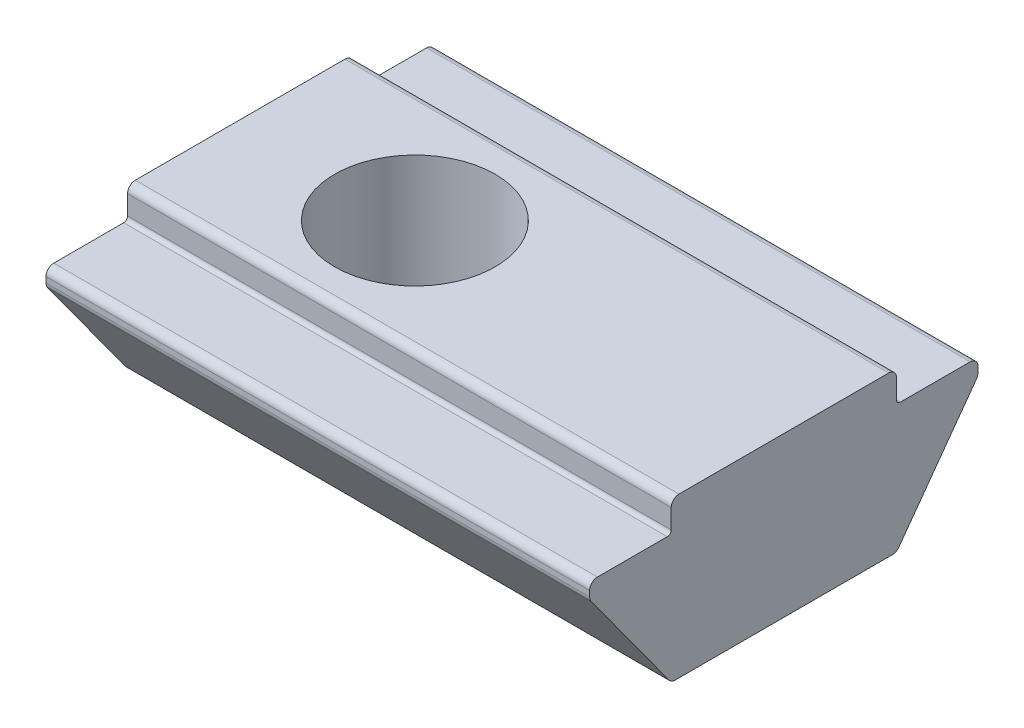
ISO-10303-21;
HEADER;
FILE_DESCRIPTION(('STEP AP214'),'2;1');
FILE_NAME('part.step','',(''),(''),'','','');
FILE_SCHEMA(('AUTOMOTIVE_DESIGN { 1 0 10303 214 1 1 1 1 }'));
ENDSEC;
DATA;
#1=APPLICATION_CONTEXT('core data for automotive mechanical design processes');
#2=APPLICATION_PROTOCOL_DEFINITION('international standard','automotive_design',2000,#1);
#3=PRODUCT_CONTEXT('',#1,'mechanical');
#4=PRODUCT('Part','Part','',(#3));
#5=PRODUCT_RELATED_PRODUCT_CATEGORY('part','',(#4));
#6=PRODUCT_DEFINITION_FORMATION('','',#4);
#7=PRODUCT_DEFINITION_CONTEXT('part definition',#1,'design');
#8=PRODUCT_DEFINITION('design','',#6,#7);
#9=PRODUCT_DEFINITION_SHAPE('','',#8);
#10=(LENGTH_UNIT() NAMED_UNIT(*) SI_UNIT(.MILLI.,.METRE.));
#11=(NAMED_UNIT(*) PLANE_ANGLE_UNIT() SI_UNIT($,.RADIAN.));
#12=(NAMED_UNIT(*) SI_UNIT($,.STERADIAN.) SOLID_ANGLE_UNIT());
#13=UNCERTAINTY_MEASURE_WITH_UNIT(LENGTH_MEASURE(1.E-05),#10,'distance_accuracy_value','');
#14=(GEOMETRIC_REPRESENTATION_CONTEXT(3) GLOBAL_UNCERTAINTY_ASSIGNED_CONTEXT((#13)) GLOBAL_UNIT_ASSIGNED_CONTEXT((#10,
#11,#12)) REPRESENTATION_CONTEXT('',''));
#15=CARTESIAN_POINT('',(0.,0.,0.));
#16=DIRECTION('',(0.,0.,1.));
#17=DIRECTION('',(1.,0.,0.));
#18=AXIS2_PLACEMENT_3D('',#15,#16,#17);
#19=CARTESIAN_POINT('',(9.5,-3.3,-2.9));
#20=DIRECTION('',(0.,1.,0.));
#21=DIRECTION('',(0.,0.,1.));
#22=AXIS2_PLACEMENT_3D('',#19,#20,#21);
#23=PLANE('',#22);
#24=CARTESIAN_POINT('',(0.,-3.3,0.));
#25=DIRECTION('',(0.,1.,0.));
#26=DIRECTION('',(0.,0.,1.));
#27=AXIS2_PLACEMENT_3D('',#24,#25,#26);
#28=CIRCLE('',#27,2.067);
#29=CARTESIAN_POINT('',(0.,-3.3,2.067));
#30=VERTEX_POINT('',#29);
#31=EDGE_CURVE('E595',#30,#30,#28,.T.);
#32=ORIENTED_EDGE('',*,*,#31,.T.);
#33=EDGE_LOOP('',(#32));
#34=FACE_BOUND('',#33,.T.);
#35=DIRECTION('',(0.,0.,-1.));
#36=VECTOR('',#35,1.);
#37=CARTESIAN_POINT('',(-4.5,-3.3,-2.9));
#38=LINE('',#37,#36);
#39=CARTESIAN_POINT('',(-4.5,-3.3,2.79809491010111));
#40=VERTEX_POINT('',#39);
#41=CARTESIAN_POINT('',(-4.5,-3.3,-2.79809491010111));
#42=VERTEX_POINT('',#41);
#43=EDGE_CURVE('E291',#40,#42,#38,.T.);
#44=ORIENTED_EDGE('',*,*,#43,.T.);
#45=DIRECTION('',(-1.,0.,0.));
#46=VECTOR('',#45,1.);
#47=CARTESIAN_POINT('',(9.5,-3.3,-2.79809491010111));
#48=LINE('',#47,#46);
#49=CARTESIAN_POINT('',(9.5,-3.3,-2.79809491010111));
#50=VERTEX_POINT('',#49);
#51=EDGE_CURVE('E11',#42,#50,#48,.F.);
#52=ORIENTED_EDGE('',*,*,#51,.T.);
#53=DIRECTION('',(0.,0.,-1.));
#54=VECTOR('',#53,1.);
#55=CARTESIAN_POINT('',(9.5,-3.3,-2.9));
#56=LINE('',#55,#54);
#57=CARTESIAN_POINT('',(9.5,-3.3,2.79809491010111));
#58=VERTEX_POINT('',#57);
#59=EDGE_CURVE('E294',#58,#50,#56,.T.);
#60=ORIENTED_EDGE('',*,*,#59,.F.);
#61=DIRECTION('',(-1.,0.,0.));
#62=VECTOR('',#61,1.);
#63=CARTESIAN_POINT('',(9.5,-3.3,2.79809491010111));
#64=LINE('',#63,#62);
#65=EDGE_CURVE('E42',#58,#40,#64,.T.);
#66=ORIENTED_EDGE('',*,*,#65,.T.);
#67=EDGE_LOOP('',(#44,#52,#60,#66));
#68=FACE_BOUND('',#67,.T.);
#69=CARTESIAN_POINT('',(6.,-3.3,0.));
#70=DIRECTION('',(0.,1.,0.));
#71=DIRECTION('',(0.,0.,1.));
#72=AXIS2_PLACEMENT_3D('',#69,#70,#71);
#73=CIRCLE('',#72,1.75);
#74=CARTESIAN_POINT('',(6.,-3.3,1.75));
#75=VERTEX_POINT('',#74);
#76=EDGE_CURVE('E329',#75,#75,#73,.T.);
#77=ORIENTED_EDGE('',*,*,#76,.T.);
#78=EDGE_LOOP('',(#77));
#79=FACE_BOUND('',#78,.T.);
#80=ADVANCED_FACE('F34',(#34,#68,#79),#23,.F.);
#81=CARTESIAN_POINT('',(9.5,0.,2.9));
#82=DIRECTION('',(0.,0.,-1.));
#83=DIRECTION('',(0.,1.,0.));
#84=AXIS2_PLACEMENT_3D('',#81,#82,#83);
#85=PLANE('',#84);
#86=DIRECTION('',(0.,-1.,0.));
#87=VECTOR('',#86,1.);
#88=CARTESIAN_POINT('',(9.5,0.,2.9));
#89=LINE('',#88,#87);
#90=CARTESIAN_POINT('',(9.5,0.6,2.9));
#91=VERTEX_POINT('',#90);
#92=CARTESIAN_POINT('',(9.5,0.1,2.9));
#93=VERTEX_POINT('',#92);
#94=EDGE_CURVE('E203',#91,#93,#89,.T.);
#95=ORIENTED_EDGE('',*,*,#94,.F.);
#96=DIRECTION('',(-1.,0.,0.));
#97=VECTOR('',#96,1.);
#98=CARTESIAN_POINT('',(9.5,0.6,2.9));
#99=LINE('',#98,#97);
#100=CARTESIAN_POINT('',(-4.5,0.6,2.9));
#101=VERTEX_POINT('',#100);
#102=EDGE_CURVE('E258',#91,#101,#99,.T.);
#103=ORIENTED_EDGE('',*,*,#102,.T.);
#104=DIRECTION('',(0.,-1.,0.));
#105=VECTOR('',#104,1.);
#106=CARTESIAN_POINT('',(-4.5,0.,2.9));
#107=LINE('',#106,#105);
#108=CARTESIAN_POINT('',(-4.5,0.1,2.9));
#109=VERTEX_POINT('',#108);
#110=EDGE_CURVE('E326',#101,#109,#107,.T.);
#111=ORIENTED_EDGE('',*,*,#110,.T.);
#112=DIRECTION('',(-1.,0.,0.));
#113=VECTOR('',#112,1.);
#114=CARTESIAN_POINT('',(9.5,0.1,2.9));
#115=LINE('',#114,#113);
#116=EDGE_CURVE('E184',#109,#93,#115,.F.);
#117=ORIENTED_EDGE('',*,*,#116,.T.);
#118=EDGE_LOOP('',(#95,#103,#111,#117));
#119=FACE_BOUND('',#118,.T.);
#120=ADVANCED_FACE('F378',(#119),#85,.F.);
#121=CARTESIAN_POINT('',(9.5,0.,5.));
#122=DIRECTION('',(0.,-1.,0.));
#123=DIRECTION('',(0.,0.,-1.));
#124=AXIS2_PLACEMENT_3D('',#121,#122,#123);
#125=PLANE('',#124);
#126=DIRECTION('',(0.,0.,1.));
#127=VECTOR('',#126,1.);
#128=CARTESIAN_POINT('',(-4.5,0.,5.));
#129=LINE('',#128,#127);
#130=CARTESIAN_POINT('',(-4.5,0.,3.));
#131=VERTEX_POINT('',#130);
#132=CARTESIAN_POINT('',(-4.5,0.,4.8));
#133=VERTEX_POINT('',#132);
#134=EDGE_CURVE('E328',#131,#133,#129,.T.);
#135=ORIENTED_EDGE('',*,*,#134,.T.);
#136=DIRECTION('',(-1.,0.,0.));
#137=VECTOR('',#136,1.);
#138=CARTESIAN_POINT('',(9.5,0.,4.8));
#139=LINE('',#138,#137);
#140=CARTESIAN_POINT('',(9.5,0.,4.8));
#141=VERTEX_POINT('',#140);
#142=EDGE_CURVE('E273',#133,#141,#139,.F.);
#143=ORIENTED_EDGE('',*,*,#142,.T.);
#144=DIRECTION('',(0.,0.,1.));
#145=VECTOR('',#144,1.);
#146=CARTESIAN_POINT('',(9.5,0.,5.));
#147=LINE('',#146,#145);
#148=CARTESIAN_POINT('',(9.5,0.,3.));
#149=VERTEX_POINT('',#148);
#150=EDGE_CURVE('E353',#149,#141,#147,.T.);
#151=ORIENTED_EDGE('',*,*,#150,.F.);
#152=DIRECTION('',(-1.,0.,0.));
#153=VECTOR('',#152,1.);
#154=CARTESIAN_POINT('',(-4.5,0.,3.));
#155=LINE('',#154,#153);
#156=EDGE_CURVE('E210',#149,#131,#155,.T.);
#157=ORIENTED_EDGE('',*,*,#156,.T.);
#158=EDGE_LOOP('',(#135,#143,#151,#157));
#159=FACE_BOUND('',#158,.T.);
#160=ADVANCED_FACE('F384',(#159),#125,.F.);
#161=CARTESIAN_POINT('',(9.5,0.,5.));
#162=DIRECTION('',(0.,0.,-1.));
#163=DIRECTION('',(-1.,0.,0.));
#164=AXIS2_PLACEMENT_3D('',#161,#162,#163);
#165=PLANE('',#164);
#166=DIRECTION('',(0.,-1.,0.));
#167=VECTOR('',#166,1.);
#168=CARTESIAN_POINT('',(9.5,0.,5.));
#169=LINE('',#168,#167);
#170=CARTESIAN_POINT('',(9.5,-0.2,5.));
#171=VERTEX_POINT('',#170);
#172=CARTESIAN_POINT('',(9.5,-0.344614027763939,5.));
#173=VERTEX_POINT('',#172);
#174=EDGE_CURVE('E347',#171,#173,#169,.T.);
#175=ORIENTED_EDGE('',*,*,#174,.F.);
#176=DIRECTION('',(-1.,0.,0.));
#177=VECTOR('',#176,1.);
#178=CARTESIAN_POINT('',(9.5,-0.2,5.));
#179=LINE('',#178,#177);
#180=CARTESIAN_POINT('',(-4.5,-0.2,5.));
#181=VERTEX_POINT('',#180);
#182=EDGE_CURVE('E270',#171,#181,#179,.T.);
#183=ORIENTED_EDGE('',*,*,#182,.T.);
#184=DIRECTION('',(0.,-1.,0.));
#185=VECTOR('',#184,1.);
#186=CARTESIAN_POINT('',(-4.5,0.,5.));
#187=LINE('',#186,#185);
#188=CARTESIAN_POINT('',(-4.5,-0.344614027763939,5.));
#189=VERTEX_POINT('',#188);
#190=EDGE_CURVE('E305',#181,#189,#187,.T.);
#191=ORIENTED_EDGE('',*,*,#190,.T.);
#192=DIRECTION('',(-1.,0.,0.));
#193=VECTOR('',#192,1.);
#194=CARTESIAN_POINT('',(9.5,-0.344614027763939,5.));
#195=LINE('',#194,#193);
#196=EDGE_CURVE('E268',#189,#173,#195,.F.);
#197=ORIENTED_EDGE('',*,*,#196,.T.);
#198=EDGE_LOOP('',(#175,#183,#191,#197));
#199=FACE_BOUND('',#198,.T.);
#200=ADVANCED_FACE('F336',(#199),#165,.F.);
#201=CARTESIAN_POINT('',(9.5,-0.409597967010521,5.));
#202=DIRECTION('',(0.,0.587785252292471,-0.809016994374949));
#203=DIRECTION('',(0.,0.809016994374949,0.587785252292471));
#204=AXIS2_PLACEMENT_3D('',#201,#202,#203);
#205=PLANE('',#204);
#206=DIRECTION('',(0.,-0.809016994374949,-0.587785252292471));
#207=VECTOR('',#206,1.);
#208=CARTESIAN_POINT('',(9.5,-0.409597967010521,5.));
#209=LINE('',#208,#207);
#210=CARTESIAN_POINT('',(9.5,-0.462171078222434,4.96180339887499));
#211=VERTEX_POINT('',#210);
#212=CARTESIAN_POINT('',(9.5,-3.21755705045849,2.9598983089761));
#213=VERTEX_POINT('',#212);
#214=EDGE_CURVE('E346',#211,#213,#209,.T.);
#215=ORIENTED_EDGE('',*,*,#214,.F.);
#216=DIRECTION('',(-1.,0.,0.));
#217=VECTOR('',#216,1.);
#218=CARTESIAN_POINT('',(9.5,-0.462171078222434,4.96180339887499));
#219=LINE('',#218,#217);
#220=CARTESIAN_POINT('',(-4.5,-0.462171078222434,4.96180339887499));
#221=VERTEX_POINT('',#220);
#222=EDGE_CURVE('E282',#211,#221,#219,.T.);
#223=ORIENTED_EDGE('',*,*,#222,.T.);
#224=DIRECTION('',(0.,-0.809016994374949,-0.587785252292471));
#225=VECTOR('',#224,1.);
#226=CARTESIAN_POINT('',(-4.5,-0.409597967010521,5.));
#227=LINE('',#226,#225);
#228=CARTESIAN_POINT('',(-4.5,-3.21755705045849,2.9598983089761));
#229=VERTEX_POINT('',#228);
#230=EDGE_CURVE('E301',#221,#229,#227,.T.);
#231=ORIENTED_EDGE('',*,*,#230,.T.);
#232=DIRECTION('',(-1.,0.,0.));
#233=VECTOR('',#232,1.);
#234=CARTESIAN_POINT('',(9.5,-3.21755705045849,2.9598983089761));
#235=LINE('',#234,#233);
#236=EDGE_CURVE('E280',#229,#213,#235,.F.);
#237=ORIENTED_EDGE('',*,*,#236,.T.);
#238=EDGE_LOOP('',(#215,#223,#231,#237));
#239=FACE_BOUND('',#238,.T.);
#240=ADVANCED_FACE('F349',(#239),#205,.F.);
#241=CARTESIAN_POINT('',(9.5,-0.409597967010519,-5.));
#242=DIRECTION('',(0.,0.587785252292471,0.809016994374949));
#243=DIRECTION('',(0.,-0.809016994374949,0.587785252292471));
#244=AXIS2_PLACEMENT_3D('',#241,#242,#243);
#245=PLANE('',#244);
#246=DIRECTION('',(0.,0.809016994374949,-0.587785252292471));
#247=VECTOR('',#246,1.);
#248=CARTESIAN_POINT('',(-4.5,-0.409597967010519,-5.));
#249=LINE('',#248,#247);
#250=CARTESIAN_POINT('',(-4.5,-3.21755705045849,-2.9598983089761));
#251=VERTEX_POINT('',#250);
#252=CARTESIAN_POINT('',(-4.5,-0.462171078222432,-4.96180339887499));
#253=VERTEX_POINT('',#252);
#254=EDGE_CURVE('E300',#251,#253,#249,.T.);
#255=ORIENTED_EDGE('',*,*,#254,.T.);
#256=DIRECTION('',(-1.,0.,0.));
#257=VECTOR('',#256,1.);
#258=CARTESIAN_POINT('',(9.5,-0.462171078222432,-4.96180339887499));
#259=LINE('',#258,#257);
#260=CARTESIAN_POINT('',(9.5,-0.462171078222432,-4.96180339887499));
#261=VERTEX_POINT('',#260);
#262=EDGE_CURVE('E278',#253,#261,#259,.F.);
#263=ORIENTED_EDGE('',*,*,#262,.T.);
#264=DIRECTION('',(0.,0.809016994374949,-0.587785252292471));
#265=VECTOR('',#264,1.);
#266=CARTESIAN_POINT('',(9.5,-0.409597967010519,-5.));
#267=LINE('',#266,#265);
#268=CARTESIAN_POINT('',(9.5,-3.21755705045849,-2.9598983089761));
#269=VERTEX_POINT('',#268);
#270=EDGE_CURVE('E320',#269,#261,#267,.T.);
#271=ORIENTED_EDGE('',*,*,#270,.F.);
#272=DIRECTION('',(-1.,0.,0.));
#273=VECTOR('',#272,1.);
#274=CARTESIAN_POINT('',(9.5,-3.21755705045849,-2.9598983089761));
#275=LINE('',#274,#273);
#276=EDGE_CURVE('E275',#269,#251,#275,.T.);
#277=ORIENTED_EDGE('',*,*,#276,.T.);
#278=EDGE_LOOP('',(#255,#263,#271,#277));
#279=FACE_BOUND('',#278,.T.);
#280=ADVANCED_FACE('F365',(#279),#245,.F.);
#281=CARTESIAN_POINT('',(9.5,0.,-5.));
#282=DIRECTION('',(0.,0.,1.));
#283=DIRECTION('',(1.,0.,0.));
#284=AXIS2_PLACEMENT_3D('',#281,#282,#283);
#285=PLANE('',#284);
#286=DIRECTION('',(0.,1.,0.));
#287=VECTOR('',#286,1.);
#288=CARTESIAN_POINT('',(-4.5,0.,-5.));
#289=LINE('',#288,#287);
#290=CARTESIAN_POINT('',(-4.5,-0.344614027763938,-5.));
#291=VERTEX_POINT('',#290);
#292=CARTESIAN_POINT('',(-4.5,-0.199999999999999,-5.));
#293=VERTEX_POINT('',#292);
#294=EDGE_CURVE('E205',#291,#293,#289,.T.);
#295=ORIENTED_EDGE('',*,*,#294,.T.);
#296=DIRECTION('',(-1.,0.,0.));
#297=VECTOR('',#296,1.);
#298=CARTESIAN_POINT('',(9.5,-0.199999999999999,-5.));
#299=LINE('',#298,#297);
#300=CARTESIAN_POINT('',(9.5,-0.199999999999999,-5.));
#301=VERTEX_POINT('',#300);
#302=EDGE_CURVE('E57',#293,#301,#299,.F.);
#303=ORIENTED_EDGE('',*,*,#302,.T.);
#304=DIRECTION('',(0.,1.,0.));
#305=VECTOR('',#304,1.);
#306=CARTESIAN_POINT('',(9.5,0.,-5.));
#307=LINE('',#306,#305);
#308=CARTESIAN_POINT('',(9.5,-0.344614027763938,-5.));
#309=VERTEX_POINT('',#308);
#310=EDGE_CURVE('E317',#309,#301,#307,.T.);
#311=ORIENTED_EDGE('',*,*,#310,.F.);
#312=DIRECTION('',(-1.,0.,0.));
#313=VECTOR('',#312,1.);
#314=CARTESIAN_POINT('',(9.5,-0.344614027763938,-5.));
#315=LINE('',#314,#313);
#316=EDGE_CURVE('E264',#309,#291,#315,.T.);
#317=ORIENTED_EDGE('',*,*,#316,.T.);
#318=EDGE_LOOP('',(#295,#303,#311,#317));
#319=FACE_BOUND('',#318,.T.);
#320=ADVANCED_FACE('F309',(#319),#285,.F.);
#321=CARTESIAN_POINT('',(9.5,0.,-2.9));
#322=DIRECTION('',(0.,-1.,0.));
#323=DIRECTION('',(0.,0.,-1.));
#324=AXIS2_PLACEMENT_3D('',#321,#322,#323);
#325=PLANE('',#324);
#326=DIRECTION('',(0.,0.,1.));
#327=VECTOR('',#326,1.);
#328=CARTESIAN_POINT('',(9.5,0.,-2.9));
#329=LINE('',#328,#327);
#330=CARTESIAN_POINT('',(9.5,0.,-4.8));
#331=VERTEX_POINT('',#330);
#332=CARTESIAN_POINT('',(9.5,0.,-3.));
#333=VERTEX_POINT('',#332);
#334=EDGE_CURVE('E316',#331,#333,#329,.T.);
#335=ORIENTED_EDGE('',*,*,#334,.F.);
#336=DIRECTION('',(-1.,0.,0.));
#337=VECTOR('',#336,1.);
#338=CARTESIAN_POINT('',(9.5,0.,-4.8));
#339=LINE('',#338,#337);
#340=CARTESIAN_POINT('',(-4.5,0.,-4.8));
#341=VERTEX_POINT('',#340);
#342=EDGE_CURVE('E261',#331,#341,#339,.T.);
#343=ORIENTED_EDGE('',*,*,#342,.T.);
#344=DIRECTION('',(0.,0.,1.));
#345=VECTOR('',#344,1.);
#346=CARTESIAN_POINT('',(-4.5,0.,-2.9));
#347=LINE('',#346,#345);
#348=CARTESIAN_POINT('',(-4.5,0.,-3.));
#349=VERTEX_POINT('',#348);
#350=EDGE_CURVE('E200',#341,#349,#347,.T.);
#351=ORIENTED_EDGE('',*,*,#350,.T.);
#352=DIRECTION('',(-1.,0.,0.));
#353=VECTOR('',#352,1.);
#354=CARTESIAN_POINT('',(9.5,0.,-3.));
#355=LINE('',#354,#353);
#356=EDGE_CURVE('E179',#349,#333,#355,.F.);
#357=ORIENTED_EDGE('',*,*,#356,.T.);
#358=EDGE_LOOP('',(#335,#343,#351,#357));
#359=FACE_BOUND('',#358,.T.);
#360=ADVANCED_FACE('F315',(#359),#325,.F.);
#361=CARTESIAN_POINT('',(9.5,0.800000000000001,-2.9));
#362=DIRECTION('',(0.,0.,1.));
#363=DIRECTION('',(0.,-1.,0.));
#364=AXIS2_PLACEMENT_3D('',#361,#362,#363);
#365=PLANE('',#364);
#366=DIRECTION('',(0.,1.,0.));
#367=VECTOR('',#366,1.);
#368=CARTESIAN_POINT('',(-4.5,0.800000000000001,-2.9));
#369=LINE('',#368,#367);
#370=CARTESIAN_POINT('',(-4.5,0.100000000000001,-2.9));
#371=VERTEX_POINT('',#370);
#372=CARTESIAN_POINT('',(-4.5,0.600000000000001,-2.9));
#373=VERTEX_POINT('',#372);
#374=EDGE_CURVE('E190',#371,#373,#369,.T.);
#375=ORIENTED_EDGE('',*,*,#374,.T.);
#376=DIRECTION('',(-1.,0.,0.));
#377=VECTOR('',#376,1.);
#378=CARTESIAN_POINT('',(9.5,0.600000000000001,-2.9));
#379=LINE('',#378,#377);
#380=CARTESIAN_POINT('',(9.5,0.600000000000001,-2.9));
#381=VERTEX_POINT('',#380);
#382=EDGE_CURVE('E241',#373,#381,#379,.F.);
#383=ORIENTED_EDGE('',*,*,#382,.T.);
#384=DIRECTION('',(0.,1.,0.));
#385=VECTOR('',#384,1.);
#386=CARTESIAN_POINT('',(9.5,0.800000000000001,-2.9));
#387=LINE('',#386,#385);
#388=CARTESIAN_POINT('',(9.5,0.100000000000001,-2.9));
#389=VERTEX_POINT('',#388);
#390=EDGE_CURVE('E193',#389,#381,#387,.T.);
#391=ORIENTED_EDGE('',*,*,#390,.F.);
#392=DIRECTION('',(-1.,0.,0.));
#393=VECTOR('',#392,1.);
#394=CARTESIAN_POINT('',(-4.5,0.100000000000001,-2.9));
#395=LINE('',#394,#393);
#396=EDGE_CURVE('E177',#389,#371,#395,.T.);
#397=ORIENTED_EDGE('',*,*,#396,.T.);
#398=EDGE_LOOP('',(#375,#383,#391,#397));
#399=FACE_BOUND('',#398,.T.);
#400=ADVANCED_FACE('F189',(#399),#365,.F.);
#401=CARTESIAN_POINT('',(9.5,0.8,2.9));
#402=DIRECTION('',(0.,-1.,0.));
#403=DIRECTION('',(0.,0.,-1.));
#404=AXIS2_PLACEMENT_3D('',#401,#402,#403);
#405=PLANE('',#404);
#406=CARTESIAN_POINT('',(0.,0.800000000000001,0.));
#407=DIRECTION('',(0.,1.,0.));
#408=DIRECTION('',(0.,0.,1.));
#409=AXIS2_PLACEMENT_3D('',#406,#407,#408);
#410=CIRCLE('',#409,2.067);
#411=CARTESIAN_POINT('',(0.,0.8,2.067));
#412=VERTEX_POINT('',#411);
#413=EDGE_CURVE('E593',#412,#412,#410,.T.);
#414=ORIENTED_EDGE('',*,*,#413,.F.);
#415=EDGE_LOOP('',(#414));
#416=FACE_BOUND('',#415,.T.);
#417=DIRECTION('',(0.,0.,1.));
#418=VECTOR('',#417,1.);
#419=CARTESIAN_POINT('',(9.5,0.8,2.9));
#420=LINE('',#419,#418);
#421=CARTESIAN_POINT('',(9.5,0.800000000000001,-2.7));
#422=VERTEX_POINT('',#421);
#423=CARTESIAN_POINT('',(9.5,0.8,2.7));
#424=VERTEX_POINT('',#423);
#425=EDGE_CURVE('E194',#422,#424,#420,.T.);
#426=ORIENTED_EDGE('',*,*,#425,.F.);
#427=DIRECTION('',(-1.,0.,0.));
#428=VECTOR('',#427,1.);
#429=CARTESIAN_POINT('',(9.5,0.800000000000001,-2.7));
#430=LINE('',#429,#428);
#431=CARTESIAN_POINT('',(-4.5,0.800000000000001,-2.7));
#432=VERTEX_POINT('',#431);
#433=EDGE_CURVE('E223',#422,#432,#430,.T.);
#434=ORIENTED_EDGE('',*,*,#433,.T.);
#435=DIRECTION('',(0.,0.,1.));
#436=VECTOR('',#435,1.);
#437=CARTESIAN_POINT('',(-4.5,0.8,2.9));
#438=LINE('',#437,#436);
#439=CARTESIAN_POINT('',(-4.5,0.8,2.7));
#440=VERTEX_POINT('',#439);
#441=EDGE_CURVE('E199',#432,#440,#438,.T.);
#442=ORIENTED_EDGE('',*,*,#441,.T.);
#443=DIRECTION('',(-1.,0.,0.));
#444=VECTOR('',#443,1.);
#445=CARTESIAN_POINT('',(9.5,0.8,2.7));
#446=LINE('',#445,#444);
#447=EDGE_CURVE('E221',#440,#424,#446,.F.);
#448=ORIENTED_EDGE('',*,*,#447,.T.);
#449=EDGE_LOOP('',(#426,#434,#442,#448));
#450=FACE_BOUND('',#449,.T.);
#451=ADVANCED_FACE('F460',(#416,#450),#405,.F.);
#452=CARTESIAN_POINT('',(9.5,0.,0.));
#453=DIRECTION('',(-1.,0.,0.));
#454=DIRECTION('',(0.,0.,1.));
#455=AXIS2_PLACEMENT_3D('',#452,#453,#454);
#456=PLANE('',#455);
#457=ORIENTED_EDGE('',*,*,#390,.T.);
#458=CARTESIAN_POINT('',(9.5,0.600000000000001,-2.7));
#459=DIRECTION('',(-1.,0.,0.));
#460=DIRECTION('',(0.,0.,1.));
#461=AXIS2_PLACEMENT_3D('',#458,#459,#460);
#462=CIRCLE('',#461,0.2);
#463=EDGE_CURVE('E256',#381,#422,#462,.F.);
#464=ORIENTED_EDGE('',*,*,#463,.T.);
#465=ORIENTED_EDGE('',*,*,#425,.T.);
#466=CARTESIAN_POINT('',(9.5,0.6,2.7));
#467=DIRECTION('',(-1.,0.,0.));
#468=DIRECTION('',(0.,0.,1.));
#469=AXIS2_PLACEMENT_3D('',#466,#467,#468);
#470=CIRCLE('',#469,0.2);
#471=EDGE_CURVE('E254',#424,#91,#470,.F.);
#472=ORIENTED_EDGE('',*,*,#471,.T.);
#473=ORIENTED_EDGE('',*,*,#94,.T.);
#474=CARTESIAN_POINT('',(9.5,0.1,3.));
#475=DIRECTION('',(-1.,0.,0.));
#476=DIRECTION('',(0.,0.,1.));
#477=AXIS2_PLACEMENT_3D('',#474,#475,#476);
#478=CIRCLE('',#477,0.1);
#479=EDGE_CURVE('E219',#93,#149,#478,.T.);
#480=ORIENTED_EDGE('',*,*,#479,.T.);
#481=ORIENTED_EDGE('',*,*,#150,.T.);
#482=CARTESIAN_POINT('',(9.5,-0.2,4.8));
#483=DIRECTION('',(-1.,0.,0.));
#484=DIRECTION('',(0.,0.,1.));
#485=AXIS2_PLACEMENT_3D('',#482,#483,#484);
#486=CIRCLE('',#485,0.2);
#487=EDGE_CURVE('E251',#141,#171,#486,.F.);
#488=ORIENTED_EDGE('',*,*,#487,.T.);
#489=ORIENTED_EDGE('',*,*,#174,.T.);
#490=CARTESIAN_POINT('',(9.5,-0.344614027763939,4.8));
#491=DIRECTION('',(-1.,0.,0.));
#492=DIRECTION('',(0.,0.,1.));
#493=AXIS2_PLACEMENT_3D('',#490,#491,#492);
#494=CIRCLE('',#493,0.2);
#495=EDGE_CURVE('E247',#173,#211,#494,.F.);
#496=ORIENTED_EDGE('',*,*,#495,.T.);
#497=ORIENTED_EDGE('',*,*,#214,.T.);
#498=CARTESIAN_POINT('',(9.5,-3.1,2.79809491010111));
#499=DIRECTION('',(-1.,0.,0.));
#500=DIRECTION('',(0.,0.,1.));
#501=AXIS2_PLACEMENT_3D('',#498,#499,#500);
#502=CIRCLE('',#501,0.2);
#503=EDGE_CURVE('E243',#213,#58,#502,.F.);
#504=ORIENTED_EDGE('',*,*,#503,.T.);
#505=ORIENTED_EDGE('',*,*,#59,.T.);
#506=CARTESIAN_POINT('',(9.5,-3.1,-2.79809491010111));
#507=DIRECTION('',(-1.,0.,0.));
#508=DIRECTION('',(0.,0.,1.));
#509=AXIS2_PLACEMENT_3D('',#506,#507,#508);
#510=CIRCLE('',#509,0.2);
#511=EDGE_CURVE('E245',#50,#269,#510,.F.);
#512=ORIENTED_EDGE('',*,*,#511,.T.);
#513=ORIENTED_EDGE('',*,*,#270,.T.);
#514=CARTESIAN_POINT('',(9.5,-0.344614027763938,-4.8));
#515=DIRECTION('',(-1.,0.,0.));
#516=DIRECTION('',(0.,0.,1.));
#517=AXIS2_PLACEMENT_3D('',#514,#515,#516);
#518=CIRCLE('',#517,0.2);
#519=EDGE_CURVE('E249',#261,#309,#518,.F.);
#520=ORIENTED_EDGE('',*,*,#519,.T.);
#521=ORIENTED_EDGE('',*,*,#310,.T.);
#522=CARTESIAN_POINT('',(9.5,-0.199999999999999,-4.8));
#523=DIRECTION('',(-1.,0.,0.));
#524=DIRECTION('',(0.,0.,1.));
#525=AXIS2_PLACEMENT_3D('',#522,#523,#524);
#526=CIRCLE('',#525,0.2);
#527=EDGE_CURVE('E49',#301,#331,#526,.F.);
#528=ORIENTED_EDGE('',*,*,#527,.T.);
#529=ORIENTED_EDGE('',*,*,#334,.T.);
#530=CARTESIAN_POINT('',(9.5,0.100000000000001,-3.));
#531=DIRECTION('',(-1.,0.,0.));
#532=DIRECTION('',(0.,0.,1.));
#533=AXIS2_PLACEMENT_3D('',#530,#531,#532);
#534=CIRCLE('',#533,0.1);
#535=EDGE_CURVE('E183',#333,#389,#534,.T.);
#536=ORIENTED_EDGE('',*,*,#535,.T.);
#537=EDGE_LOOP('',(#457,#464,#465,#472,#473,#480,#481,#488,#489,#496,#497,#504,#505,#512,#513,
#520,#521,#528,#529,#536));
#538=FACE_BOUND('',#537,.T.);
#539=ADVANCED_FACE('F345',(#538),#456,.F.);
#540=CARTESIAN_POINT('',(-4.5,0.,0.));
#541=DIRECTION('',(-1.,0.,0.));
#542=DIRECTION('',(0.,0.,1.));
#543=AXIS2_PLACEMENT_3D('',#540,#541,#542);
#544=PLANE('',#543);
#545=ORIENTED_EDGE('',*,*,#441,.F.);
#546=CARTESIAN_POINT('',(-4.5,0.600000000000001,-2.7));
#547=DIRECTION('',(-1.,0.,0.));
#548=DIRECTION('',(0.,0.,1.));
#549=AXIS2_PLACEMENT_3D('',#546,#547,#548);
#550=CIRCLE('',#549,0.2);
#551=EDGE_CURVE('E198',#432,#373,#550,.T.);
#552=ORIENTED_EDGE('',*,*,#551,.T.);
#553=ORIENTED_EDGE('',*,*,#374,.F.);
#554=CARTESIAN_POINT('',(-4.5,0.100000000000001,-3.));
#555=DIRECTION('',(-1.,0.,0.));
#556=DIRECTION('',(0.,0.,1.));
#557=AXIS2_PLACEMENT_3D('',#554,#555,#556);
#558=CIRCLE('',#557,0.1);
#559=EDGE_CURVE('E173',#371,#349,#558,.F.);
#560=ORIENTED_EDGE('',*,*,#559,.T.);
#561=ORIENTED_EDGE('',*,*,#350,.F.);
#562=CARTESIAN_POINT('',(-4.5,-0.199999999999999,-4.8));
#563=DIRECTION('',(-1.,0.,0.));
#564=DIRECTION('',(0.,0.,1.));
#565=AXIS2_PLACEMENT_3D('',#562,#563,#564);
#566=CIRCLE('',#565,0.2);
#567=EDGE_CURVE('E236',#341,#293,#566,.T.);
#568=ORIENTED_EDGE('',*,*,#567,.T.);
#569=ORIENTED_EDGE('',*,*,#294,.F.);
#570=CARTESIAN_POINT('',(-4.5,-0.344614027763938,-4.8));
#571=DIRECTION('',(-1.,0.,0.));
#572=DIRECTION('',(0.,0.,1.));
#573=AXIS2_PLACEMENT_3D('',#570,#571,#572);
#574=CIRCLE('',#573,0.2);
#575=EDGE_CURVE('E232',#291,#253,#574,.T.);
#576=ORIENTED_EDGE('',*,*,#575,.T.);
#577=ORIENTED_EDGE('',*,*,#254,.F.);
#578=CARTESIAN_POINT('',(-4.5,-3.1,-2.79809491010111));
#579=DIRECTION('',(-1.,0.,0.));
#580=DIRECTION('',(0.,0.,1.));
#581=AXIS2_PLACEMENT_3D('',#578,#579,#580);
#582=CIRCLE('',#581,0.2);
#583=EDGE_CURVE('E228',#251,#42,#582,.T.);
#584=ORIENTED_EDGE('',*,*,#583,.T.);
#585=ORIENTED_EDGE('',*,*,#43,.F.);
#586=CARTESIAN_POINT('',(-4.5,-3.1,2.79809491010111));
#587=DIRECTION('',(-1.,0.,0.));
#588=DIRECTION('',(0.,0.,1.));
#589=AXIS2_PLACEMENT_3D('',#586,#587,#588);
#590=CIRCLE('',#589,0.2);
#591=EDGE_CURVE('E226',#40,#229,#590,.T.);
#592=ORIENTED_EDGE('',*,*,#591,.T.);
#593=ORIENTED_EDGE('',*,*,#230,.F.);
#594=CARTESIAN_POINT('',(-4.5,-0.344614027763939,4.8));
#595=DIRECTION('',(-1.,0.,0.));
#596=DIRECTION('',(0.,0.,1.));
#597=AXIS2_PLACEMENT_3D('',#594,#595,#596);
#598=CIRCLE('',#597,0.2);
#599=EDGE_CURVE('E230',#221,#189,#598,.T.);
#600=ORIENTED_EDGE('',*,*,#599,.T.);
#601=ORIENTED_EDGE('',*,*,#190,.F.);
#602=CARTESIAN_POINT('',(-4.5,-0.2,4.8));
#603=DIRECTION('',(-1.,0.,0.));
#604=DIRECTION('',(0.,0.,1.));
#605=AXIS2_PLACEMENT_3D('',#602,#603,#604);
#606=CIRCLE('',#605,0.2);
#607=EDGE_CURVE('E234',#181,#133,#606,.T.);
#608=ORIENTED_EDGE('',*,*,#607,.T.);
#609=ORIENTED_EDGE('',*,*,#134,.F.);
#610=CARTESIAN_POINT('',(-4.5,0.1,3.));
#611=DIRECTION('',(-1.,0.,0.));
#612=DIRECTION('',(0.,0.,1.));
#613=AXIS2_PLACEMENT_3D('',#610,#611,#612);
#614=CIRCLE('',#613,0.1);
#615=EDGE_CURVE('E216',#131,#109,#614,.F.);
#616=ORIENTED_EDGE('',*,*,#615,.T.);
#617=ORIENTED_EDGE('',*,*,#110,.F.);
#618=CARTESIAN_POINT('',(-4.5,0.6,2.7));
#619=DIRECTION('',(-1.,0.,0.));
#620=DIRECTION('',(0.,0.,1.));
#621=AXIS2_PLACEMENT_3D('',#618,#619,#620);
#622=CIRCLE('',#621,0.2);
#623=EDGE_CURVE('E238',#101,#440,#622,.T.);
#624=ORIENTED_EDGE('',*,*,#623,.T.);
#625=EDGE_LOOP('',(#545,#552,#553,#560,#561,#568,#569,#576,#577,#584,#585,#592,#593,#600,#601,
#608,#609,#616,#617,#624));
#626=FACE_BOUND('',#625,.T.);
#627=ADVANCED_FACE('F197',(#626),#544,.T.);
#628=CARTESIAN_POINT('',(9.5,0.100000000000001,-3.));
#629=DIRECTION('',(1.,0.,0.));
#630=DIRECTION('',(0.,0.,-1.));
#631=AXIS2_PLACEMENT_3D('',#628,#629,#630);
#632=CYLINDRICAL_SURFACE('',#631,0.1);
#633=ORIENTED_EDGE('',*,*,#535,.F.);
#634=ORIENTED_EDGE('',*,*,#356,.F.);
#635=ORIENTED_EDGE('',*,*,#559,.F.);
#636=ORIENTED_EDGE('',*,*,#396,.F.);
#637=EDGE_LOOP('',(#633,#634,#635,#636));
#638=FACE_BOUND('',#637,.T.);
#639=ADVANCED_FACE('F176',(#638),#632,.F.);
#640=CARTESIAN_POINT('',(9.5,0.1,3.));
#641=DIRECTION('',(1.,0.,0.));
#642=DIRECTION('',(0.,0.,-1.));
#643=AXIS2_PLACEMENT_3D('',#640,#641,#642);
#644=CYLINDRICAL_SURFACE('',#643,0.1);
#645=ORIENTED_EDGE('',*,*,#479,.F.);
#646=ORIENTED_EDGE('',*,*,#116,.F.);
#647=ORIENTED_EDGE('',*,*,#615,.F.);
#648=ORIENTED_EDGE('',*,*,#156,.F.);
#649=EDGE_LOOP('',(#645,#646,#647,#648));
#650=FACE_BOUND('',#649,.T.);
#651=ADVANCED_FACE('F400',(#650),#644,.F.);
#652=CARTESIAN_POINT('',(9.5,0.600000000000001,-2.7));
#653=DIRECTION('',(-1.,0.,0.));
#654=DIRECTION('',(0.,0.,1.));
#655=AXIS2_PLACEMENT_3D('',#652,#653,#654);
#656=CYLINDRICAL_SURFACE('',#655,0.2);
#657=ORIENTED_EDGE('',*,*,#463,.F.);
#658=ORIENTED_EDGE('',*,*,#382,.F.);
#659=ORIENTED_EDGE('',*,*,#551,.F.);
#660=ORIENTED_EDGE('',*,*,#433,.F.);
#661=EDGE_LOOP('',(#657,#658,#659,#660));
#662=FACE_BOUND('',#661,.T.);
#663=ADVANCED_FACE('F403',(#662),#656,.T.);
#664=CARTESIAN_POINT('',(9.5,0.6,2.7));
#665=DIRECTION('',(-1.,0.,0.));
#666=DIRECTION('',(0.,0.,1.));
#667=AXIS2_PLACEMENT_3D('',#664,#665,#666);
#668=CYLINDRICAL_SURFACE('',#667,0.2);
#669=ORIENTED_EDGE('',*,*,#471,.F.);
#670=ORIENTED_EDGE('',*,*,#447,.F.);
#671=ORIENTED_EDGE('',*,*,#623,.F.);
#672=ORIENTED_EDGE('',*,*,#102,.F.);
#673=EDGE_LOOP('',(#669,#670,#671,#672));
#674=FACE_BOUND('',#673,.T.);
#675=ADVANCED_FACE('F407',(#674),#668,.T.);
#676=CARTESIAN_POINT('',(9.5,-0.199999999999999,-4.8));
#677=DIRECTION('',(-1.,0.,0.));
#678=DIRECTION('',(0.,0.,1.));
#679=AXIS2_PLACEMENT_3D('',#676,#677,#678);
#680=CYLINDRICAL_SURFACE('',#679,0.2);
#681=ORIENTED_EDGE('',*,*,#527,.F.);
#682=ORIENTED_EDGE('',*,*,#302,.F.);
#683=ORIENTED_EDGE('',*,*,#567,.F.);
#684=ORIENTED_EDGE('',*,*,#342,.F.);
#685=EDGE_LOOP('',(#681,#682,#683,#684));
#686=FACE_BOUND('',#685,.T.);
#687=ADVANCED_FACE('F312',(#686),#680,.T.);
#688=CARTESIAN_POINT('',(9.5,-0.2,4.8));
#689=DIRECTION('',(-1.,0.,0.));
#690=DIRECTION('',(0.,0.,1.));
#691=AXIS2_PLACEMENT_3D('',#688,#689,#690);
#692=CYLINDRICAL_SURFACE('',#691,0.2);
#693=ORIENTED_EDGE('',*,*,#487,.F.);
#694=ORIENTED_EDGE('',*,*,#142,.F.);
#695=ORIENTED_EDGE('',*,*,#607,.F.);
#696=ORIENTED_EDGE('',*,*,#182,.F.);
#697=EDGE_LOOP('',(#693,#694,#695,#696));
#698=FACE_BOUND('',#697,.T.);
#699=ADVANCED_FACE('F414',(#698),#692,.T.);
#700=CARTESIAN_POINT('',(9.5,-0.344614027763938,-4.8));
#701=DIRECTION('',(-1.,0.,0.));
#702=DIRECTION('',(0.,0.,1.));
#703=AXIS2_PLACEMENT_3D('',#700,#701,#702);
#704=CYLINDRICAL_SURFACE('',#703,0.2);
#705=ORIENTED_EDGE('',*,*,#519,.F.);
#706=ORIENTED_EDGE('',*,*,#262,.F.);
#707=ORIENTED_EDGE('',*,*,#575,.F.);
#708=ORIENTED_EDGE('',*,*,#316,.F.);
#709=EDGE_LOOP('',(#705,#706,#707,#708));
#710=FACE_BOUND('',#709,.T.);
#711=ADVANCED_FACE('F364',(#710),#704,.T.);
#712=CARTESIAN_POINT('',(9.5,-0.344614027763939,4.8));
#713=DIRECTION('',(-1.,0.,0.));
#714=DIRECTION('',(0.,0.,1.));
#715=AXIS2_PLACEMENT_3D('',#712,#713,#714);
#716=CYLINDRICAL_SURFACE('',#715,0.2);
#717=ORIENTED_EDGE('',*,*,#495,.F.);
#718=ORIENTED_EDGE('',*,*,#196,.F.);
#719=ORIENTED_EDGE('',*,*,#599,.F.);
#720=ORIENTED_EDGE('',*,*,#222,.F.);
#721=EDGE_LOOP('',(#717,#718,#719,#720));
#722=FACE_BOUND('',#721,.T.);
#723=ADVANCED_FACE('F341',(#722),#716,.T.);
#724=CARTESIAN_POINT('',(9.5,-3.1,-2.79809491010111));
#725=DIRECTION('',(-1.,0.,0.));
#726=DIRECTION('',(0.,0.,1.));
#727=AXIS2_PLACEMENT_3D('',#724,#725,#726);
#728=CYLINDRICAL_SURFACE('',#727,0.2);
#729=ORIENTED_EDGE('',*,*,#511,.F.);
#730=ORIENTED_EDGE('',*,*,#51,.F.);
#731=ORIENTED_EDGE('',*,*,#583,.F.);
#732=ORIENTED_EDGE('',*,*,#276,.F.);
#733=EDGE_LOOP('',(#729,#730,#731,#732));
#734=FACE_BOUND('',#733,.T.);
#735=ADVANCED_FACE('F367',(#734),#728,.T.);
#736=CARTESIAN_POINT('',(9.5,-3.1,2.79809491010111));
#737=DIRECTION('',(-1.,0.,0.));
#738=DIRECTION('',(0.,0.,1.));
#739=AXIS2_PLACEMENT_3D('',#736,#737,#738);
#740=CYLINDRICAL_SURFACE('',#739,0.2);
#741=ORIENTED_EDGE('',*,*,#503,.F.);
#742=ORIENTED_EDGE('',*,*,#236,.F.);
#743=ORIENTED_EDGE('',*,*,#591,.F.);
#744=ORIENTED_EDGE('',*,*,#65,.F.);
#745=EDGE_LOOP('',(#741,#742,#743,#744));
#746=FACE_BOUND('',#745,.T.);
#747=ADVANCED_FACE('F36',(#746),#740,.T.);
#748=CARTESIAN_POINT('',(6.,0.,0.));
#749=DIRECTION('',(0.,1.,0.));
#750=DIRECTION('',(0.,0.,1.));
#751=AXIS2_PLACEMENT_3D('',#748,#749,#750);
#752=CYLINDRICAL_SURFACE('',#751,1.75);
#753=CARTESIAN_POINT('',(6.,-2.25,0.));
#754=DIRECTION('',(0.,1.,0.));
#755=DIRECTION('',(0.,0.,1.));
#756=AXIS2_PLACEMENT_3D('',#753,#754,#755);
#757=CIRCLE('',#756,1.75);
#758=CARTESIAN_POINT('',(6.,-2.25,1.75));
#759=VERTEX_POINT('',#758);
#760=EDGE_CURVE('E596',#759,#759,#757,.T.);
#761=ORIENTED_EDGE('',*,*,#760,.T.);
#762=EDGE_LOOP('',(#761));
#763=FACE_BOUND('',#762,.T.);
#764=ORIENTED_EDGE('',*,*,#76,.F.);
#765=EDGE_LOOP('',(#764));
#766=FACE_BOUND('',#765,.T.);
#767=ADVANCED_FACE('F369',(#763,#766),#752,.F.);
#768=CARTESIAN_POINT('',(6.,-2.25,0.));
#769=DIRECTION('',(0.,1.,0.));
#770=DIRECTION('',(0.,0.,1.));
#771=AXIS2_PLACEMENT_3D('',#768,#769,#770);
#772=SPHERICAL_SURFACE('',#771,1.75);
#773=ORIENTED_EDGE('',*,*,#760,.F.);
#774=EDGE_LOOP('',(#773));
#775=FACE_BOUND('',#774,.T.);
#776=ADVANCED_FACE('F374',(#775),#772,.T.);
#777=CARTESIAN_POINT('',(0.,0.800000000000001,0.));
#778=DIRECTION('',(0.,1.,0.));
#779=DIRECTION('',(0.,0.,1.));
#780=AXIS2_PLACEMENT_3D('',#777,#778,#779);
#781=CYLINDRICAL_SURFACE('',#780,2.067);
#782=ORIENTED_EDGE('',*,*,#413,.T.);
#783=EDGE_LOOP('',(#782));
#784=FACE_BOUND('',#783,.T.);
#785=ORIENTED_EDGE('',*,*,#31,.F.);
#786=EDGE_LOOP('',(#785));
#787=FACE_BOUND('',#786,.T.);
#788=ADVANCED_FACE('F448',(#784,#787),#781,.F.);
#789=CLOSED_SHELL('',(#80,#120,#160,#200,#240,#280,#320,#360,#400,#451,#539,#627,#639,#651,#663,
#675,#687,#699,#711,#723,#735,#747,#767,#776,#788));
#790=MANIFOLD_SOLID_BREP('B2',#789);
#791=ADVANCED_BREP_SHAPE_REPRESENTATION('',(#18,#790),#14);
#792=SHAPE_DEFINITION_REPRESENTATION(#9,#791);
ENDSEC;
END-ISO-10303-21;
